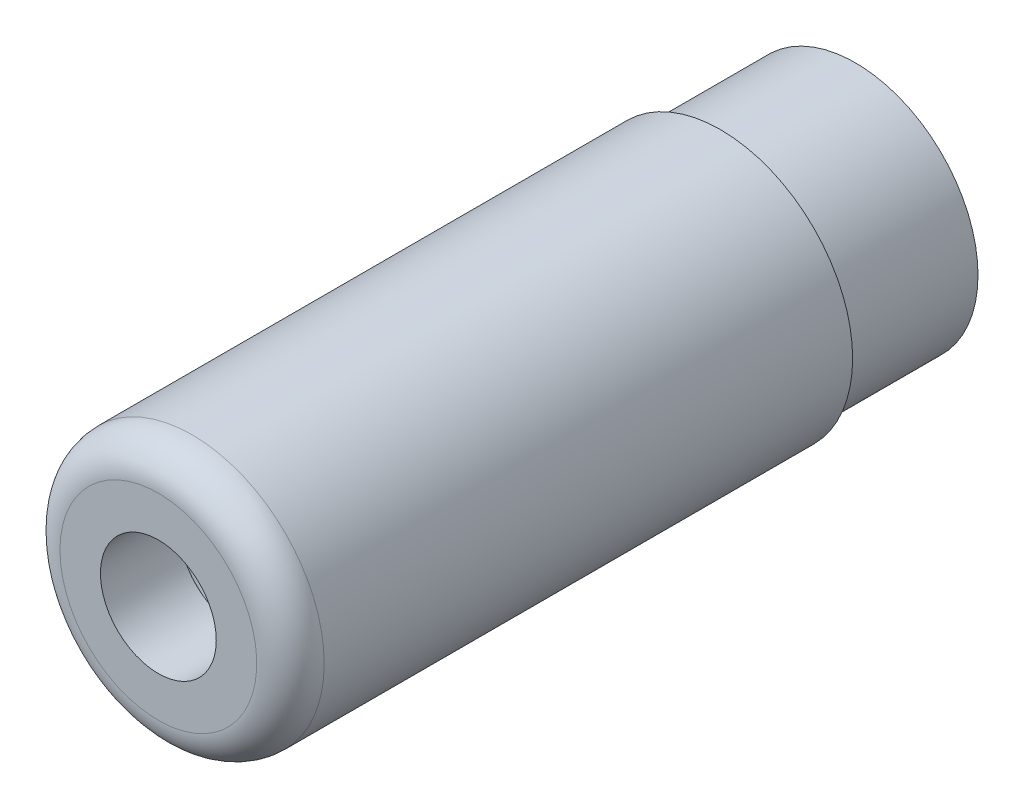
from build123d import *

# Parameters (mm, degrees)
HOLE1_D     = 2.6162
HOLE2_D     = 4.7498
HOLE2_DEPTH = 13.97
FILLET2_R   = 0.762


with BuildPart() as part:
    # Sketch1 → Revolve1 (revolve)
    with BuildSketch(Plane(origin=(0, 0, 0), x_dir=(0, 0, -1), z_dir=(1, 0, 0)), mode=Mode.PRIVATE) as revolve1_sk:
        Polygon((-7.874, 0), (-7.874, 2.9845), (4.826, 2.9845), (4.826, 2.7686), (7.874, 2.7686), (7.874, 0), align=None)
    revolve(revolve1_sk.sketch.rotate(Axis((0, 0, 24.145215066), (0, 0, -1)), 90), axis=Axis((0, 0, 24.145215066), (0, 0, -1)))

    # Hole1 (through all)
    with Locations(Plane.XY.offset(7.874)):
        with Locations((0, 0)):
            Hole(HOLE1_D / 2)

    # Hole2
    with Locations(Plane(origin=(0, 0, -7.874), x_dir=(-1, 0, 0), z_dir=(0, 0, -1))):
        with Locations((0, 0)):
            Hole(HOLE2_D / 2, depth=HOLE2_DEPTH)

    # Fillet2
    fillet2_edges = [part.edges().sort_by_distance(p)[0] for p in [
        (-2.3749, 0, 6.096),
        (-2.9845, 0, 7.874),
    ]]
    fillet(fillet2_edges, radius=FILLET2_R)


solid = part.part
